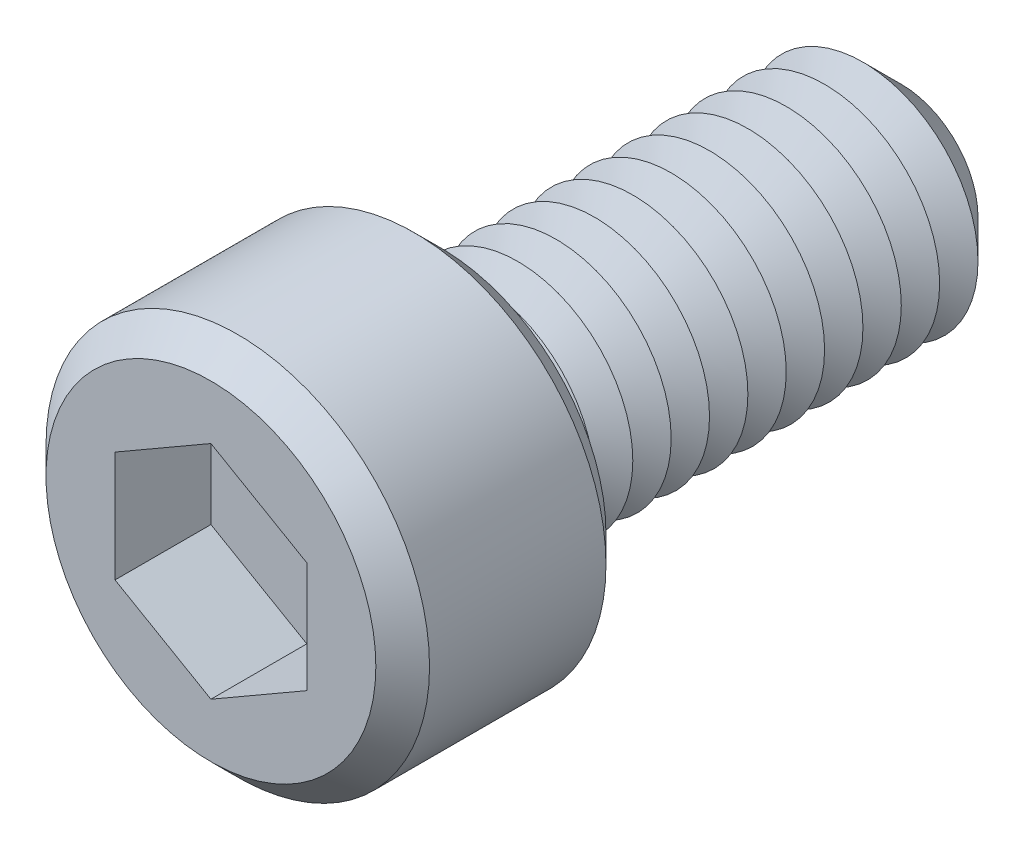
ISO-10303-21;
HEADER;
FILE_DESCRIPTION(('STEP AP214'),'2;1');
FILE_NAME('part.step','',(''),(''),'','','');
FILE_SCHEMA(('AUTOMOTIVE_DESIGN { 1 0 10303 214 1 1 1 1 }'));
ENDSEC;
DATA;
#1=APPLICATION_CONTEXT('core data for automotive mechanical design processes');
#2=APPLICATION_PROTOCOL_DEFINITION('international standard','automotive_design',2000,#1);
#3=PRODUCT_CONTEXT('',#1,'mechanical');
#4=PRODUCT('Part','Part','',(#3));
#5=PRODUCT_RELATED_PRODUCT_CATEGORY('part','',(#4));
#6=PRODUCT_DEFINITION_FORMATION('','',#4);
#7=PRODUCT_DEFINITION_CONTEXT('part definition',#1,'design');
#8=PRODUCT_DEFINITION('design','',#6,#7);
#9=PRODUCT_DEFINITION_SHAPE('','',#8);
#10=(LENGTH_UNIT() NAMED_UNIT(*) SI_UNIT(.MILLI.,.METRE.));
#11=(NAMED_UNIT(*) PLANE_ANGLE_UNIT() SI_UNIT($,.RADIAN.));
#12=(NAMED_UNIT(*) SI_UNIT($,.STERADIAN.) SOLID_ANGLE_UNIT());
#13=UNCERTAINTY_MEASURE_WITH_UNIT(LENGTH_MEASURE(1.E-05),#10,'distance_accuracy_value','');
#14=(GEOMETRIC_REPRESENTATION_CONTEXT(3) GLOBAL_UNCERTAINTY_ASSIGNED_CONTEXT((#13)) GLOBAL_UNIT_ASSIGNED_CONTEXT((#10,
#11,#12)) REPRESENTATION_CONTEXT('',''));
#15=CARTESIAN_POINT('',(0.,0.,0.));
#16=DIRECTION('',(0.,0.,1.));
#17=DIRECTION('',(1.,0.,0.));
#18=AXIS2_PLACEMENT_3D('',#15,#16,#17);
#19=CARTESIAN_POINT('',(0.,0.,6.));
#20=DIRECTION('',(0.,0.,-1.));
#21=DIRECTION('',(-1.,0.,0.));
#22=AXIS2_PLACEMENT_3D('',#19,#20,#21);
#23=CYLINDRICAL_SURFACE('',#22,5.);
#24=CARTESIAN_POINT('',(0.,0.,0.700000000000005));
#25=DIRECTION('',(0.,0.,1.));
#26=DIRECTION('',(1.,0.,0.));
#27=AXIS2_PLACEMENT_3D('',#24,#25,#26);
#28=CIRCLE('',#27,5.);
#29=CARTESIAN_POINT('',(5.,0.,0.700000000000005));
#30=VERTEX_POINT('',#29);
#31=EDGE_CURVE('E264',#30,#30,#28,.T.);
#32=ORIENTED_EDGE('',*,*,#31,.T.);
#33=EDGE_LOOP('',(#32));
#34=FACE_BOUND('',#33,.T.);
#35=CARTESIAN_POINT('',(0.,0.,5.3));
#36=DIRECTION('',(0.,0.,1.));
#37=DIRECTION('',(1.,0.,0.));
#38=AXIS2_PLACEMENT_3D('',#35,#36,#37);
#39=CIRCLE('',#38,5.);
#40=CARTESIAN_POINT('',(5.,0.,5.3));
#41=VERTEX_POINT('',#40);
#42=EDGE_CURVE('E260',#41,#41,#39,.F.);
#43=ORIENTED_EDGE('',*,*,#42,.T.);
#44=EDGE_LOOP('',(#43));
#45=FACE_BOUND('',#44,.T.);
#46=ADVANCED_FACE('F39',(#34,#45),#23,.T.);
#47=CARTESIAN_POINT('',(0.,0.,6.));
#48=DIRECTION('',(0.,0.,1.));
#49=DIRECTION('',(1.,0.,0.));
#50=AXIS2_PLACEMENT_3D('',#47,#48,#49);
#51=PLANE('',#50);
#52=CARTESIAN_POINT('',(0.,0.,6.));
#53=DIRECTION('',(0.,0.,1.));
#54=DIRECTION('',(1.,0.,0.));
#55=AXIS2_PLACEMENT_3D('',#52,#53,#54);
#56=CIRCLE('',#55,4.3);
#57=CARTESIAN_POINT('',(4.3,0.,6.));
#58=VERTEX_POINT('',#57);
#59=EDGE_CURVE('E11',#58,#58,#56,.T.);
#60=ORIENTED_EDGE('',*,*,#59,.T.);
#61=EDGE_LOOP('',(#60));
#62=FACE_BOUND('',#61,.T.);
#63=DIRECTION('',(-0.866025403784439,0.5,0.));
#64=VECTOR('',#63,1.);
#65=CARTESIAN_POINT('',(2.5,1.44337567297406,6.));
#66=LINE('',#65,#64);
#67=CARTESIAN_POINT('',(2.5,1.44337567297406,6.));
#68=VERTEX_POINT('',#67);
#69=CARTESIAN_POINT('',(0.,2.88675134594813,6.));
#70=VERTEX_POINT('',#69);
#71=EDGE_CURVE('E55',#68,#70,#66,.T.);
#72=ORIENTED_EDGE('',*,*,#71,.F.);
#73=DIRECTION('',(0.,1.,0.));
#74=VECTOR('',#73,1.);
#75=CARTESIAN_POINT('',(2.5,-1.44337567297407,6.));
#76=LINE('',#75,#74);
#77=CARTESIAN_POINT('',(2.5,-1.44337567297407,6.));
#78=VERTEX_POINT('',#77);
#79=EDGE_CURVE('E150',#78,#68,#76,.T.);
#80=ORIENTED_EDGE('',*,*,#79,.F.);
#81=DIRECTION('',(0.866025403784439,0.5,0.));
#82=VECTOR('',#81,1.);
#83=CARTESIAN_POINT('',(0.,-2.88675134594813,6.));
#84=LINE('',#83,#82);
#85=CARTESIAN_POINT('',(0.,-2.88675134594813,6.));
#86=VERTEX_POINT('',#85);
#87=EDGE_CURVE('E147',#86,#78,#84,.T.);
#88=ORIENTED_EDGE('',*,*,#87,.F.);
#89=DIRECTION('',(0.866025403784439,-0.5,0.));
#90=VECTOR('',#89,1.);
#91=CARTESIAN_POINT('',(-2.5,-1.44337567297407,6.));
#92=LINE('',#91,#90);
#93=CARTESIAN_POINT('',(-2.5,-1.44337567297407,6.));
#94=VERTEX_POINT('',#93);
#95=EDGE_CURVE('E103',#94,#86,#92,.T.);
#96=ORIENTED_EDGE('',*,*,#95,.F.);
#97=DIRECTION('',(0.,-1.,0.));
#98=VECTOR('',#97,1.);
#99=CARTESIAN_POINT('',(-2.5,1.44337567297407,6.));
#100=LINE('',#99,#98);
#101=CARTESIAN_POINT('',(-2.5,1.44337567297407,6.));
#102=VERTEX_POINT('',#101);
#103=EDGE_CURVE('E141',#102,#94,#100,.T.);
#104=ORIENTED_EDGE('',*,*,#103,.F.);
#105=DIRECTION('',(-0.866025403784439,-0.5,0.));
#106=VECTOR('',#105,1.);
#107=CARTESIAN_POINT('',(0.,2.88675134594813,6.));
#108=LINE('',#107,#106);
#109=EDGE_CURVE('E136',#70,#102,#108,.T.);
#110=ORIENTED_EDGE('',*,*,#109,.F.);
#111=EDGE_LOOP('',(#72,#80,#88,#96,#104,#110));
#112=FACE_BOUND('',#111,.T.);
#113=ADVANCED_FACE('F282',(#62,#112),#51,.T.);
#114=CARTESIAN_POINT('',(0.,0.,0.));
#115=DIRECTION('',(0.,0.,1.));
#116=DIRECTION('',(1.,0.,0.));
#117=AXIS2_PLACEMENT_3D('',#114,#115,#116);
#118=PLANE('',#117);
#119=CARTESIAN_POINT('',(0.,0.,0.));
#120=DIRECTION('',(0.,0.,1.));
#121=DIRECTION('',(1.,0.,0.));
#122=AXIS2_PLACEMENT_3D('',#119,#120,#121);
#123=CIRCLE('',#122,4.29999999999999);
#124=CARTESIAN_POINT('',(4.29999999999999,0.,0.));
#125=VERTEX_POINT('',#124);
#126=EDGE_CURVE('E48',#125,#125,#123,.F.);
#127=ORIENTED_EDGE('',*,*,#126,.T.);
#128=EDGE_LOOP('',(#127));
#129=FACE_BOUND('',#128,.T.);
#130=CARTESIAN_POINT('',(0.,0.,0.));
#131=DIRECTION('',(0.,0.,1.));
#132=DIRECTION('',(1.,0.,0.));
#133=AXIS2_PLACEMENT_3D('',#130,#131,#132);
#134=CIRCLE('',#133,3.);
#135=CARTESIAN_POINT('',(3.,0.,0.));
#136=VERTEX_POINT('',#135);
#137=EDGE_CURVE('E252',#136,#136,#134,.T.);
#138=ORIENTED_EDGE('',*,*,#137,.T.);
#139=EDGE_LOOP('',(#138));
#140=FACE_BOUND('',#139,.T.);
#141=ADVANCED_FACE('F271',(#129,#140),#118,.F.);
#142=CARTESIAN_POINT('',(0.,0.,0.));
#143=DIRECTION('',(0.,0.,1.));
#144=DIRECTION('',(1.,0.,0.));
#145=AXIS2_PLACEMENT_3D('',#142,#143,#144);
#146=CONICAL_SURFACE('',#145,3.,1.0471975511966);
#147=CARTESIAN_POINT('',(0.,0.,-0.500000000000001));
#148=DIRECTION('',(0.,0.,1.));
#149=DIRECTION('',(1.,0.,0.));
#150=AXIS2_PLACEMENT_3D('',#147,#148,#149);
#151=CIRCLE('',#150,2.13397459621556);
#152=CARTESIAN_POINT('',(2.13397459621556,0.,-0.500000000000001));
#153=VERTEX_POINT('',#152);
#154=EDGE_CURVE('E248',#153,#153,#151,.T.);
#155=ORIENTED_EDGE('',*,*,#154,.T.);
#156=EDGE_LOOP('',(#155));
#157=FACE_BOUND('',#156,.T.);
#158=ORIENTED_EDGE('',*,*,#137,.F.);
#159=EDGE_LOOP('',(#158));
#160=FACE_BOUND('',#159,.T.);
#161=ADVANCED_FACE('F420',(#157,#160),#146,.T.);
#162=CARTESIAN_POINT('',(0.,0.,-0.500000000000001));
#163=DIRECTION('',(0.,0.,-1.));
#164=DIRECTION('',(-1.,0.,0.));
#165=AXIS2_PLACEMENT_3D('',#162,#163,#164);
#166=CONICAL_SURFACE('',#165,2.13397459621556,1.0471975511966);
#167=CARTESIAN_POINT('',(0.,0.,-1.));
#168=DIRECTION('',(0.,0.,1.));
#169=DIRECTION('',(1.,0.,0.));
#170=AXIS2_PLACEMENT_3D('',#167,#168,#169);
#171=CIRCLE('',#170,3.);
#172=CARTESIAN_POINT('',(3.,0.,-1.));
#173=VERTEX_POINT('',#172);
#174=EDGE_CURVE('E244',#173,#173,#171,.T.);
#175=ORIENTED_EDGE('',*,*,#174,.T.);
#176=EDGE_LOOP('',(#175));
#177=FACE_BOUND('',#176,.T.);
#178=ORIENTED_EDGE('',*,*,#154,.F.);
#179=EDGE_LOOP('',(#178));
#180=FACE_BOUND('',#179,.T.);
#181=ADVANCED_FACE('F416',(#177,#180),#166,.T.);
#182=CARTESIAN_POINT('',(0.,0.,-1.));
#183=DIRECTION('',(0.,0.,1.));
#184=DIRECTION('',(1.,0.,0.));
#185=AXIS2_PLACEMENT_3D('',#182,#183,#184);
#186=CONICAL_SURFACE('',#185,3.,1.0471975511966);
#187=CARTESIAN_POINT('',(0.,0.,-1.5));
#188=DIRECTION('',(0.,0.,1.));
#189=DIRECTION('',(1.,0.,0.));
#190=AXIS2_PLACEMENT_3D('',#187,#188,#189);
#191=CIRCLE('',#190,2.13397459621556);
#192=CARTESIAN_POINT('',(2.13397459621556,0.,-1.5));
#193=VERTEX_POINT('',#192);
#194=EDGE_CURVE('E240',#193,#193,#191,.T.);
#195=ORIENTED_EDGE('',*,*,#194,.T.);
#196=EDGE_LOOP('',(#195));
#197=FACE_BOUND('',#196,.T.);
#198=ORIENTED_EDGE('',*,*,#174,.F.);
#199=EDGE_LOOP('',(#198));
#200=FACE_BOUND('',#199,.T.);
#201=ADVANCED_FACE('F412',(#197,#200),#186,.T.);
#202=CARTESIAN_POINT('',(0.,0.,-1.5));
#203=DIRECTION('',(0.,0.,-1.));
#204=DIRECTION('',(-1.,0.,0.));
#205=AXIS2_PLACEMENT_3D('',#202,#203,#204);
#206=CONICAL_SURFACE('',#205,2.13397459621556,1.0471975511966);
#207=CARTESIAN_POINT('',(0.,0.,-2.));
#208=DIRECTION('',(0.,0.,1.));
#209=DIRECTION('',(1.,0.,0.));
#210=AXIS2_PLACEMENT_3D('',#207,#208,#209);
#211=CIRCLE('',#210,3.);
#212=CARTESIAN_POINT('',(3.,0.,-2.));
#213=VERTEX_POINT('',#212);
#214=EDGE_CURVE('E236',#213,#213,#211,.T.);
#215=ORIENTED_EDGE('',*,*,#214,.T.);
#216=EDGE_LOOP('',(#215));
#217=FACE_BOUND('',#216,.T.);
#218=ORIENTED_EDGE('',*,*,#194,.F.);
#219=EDGE_LOOP('',(#218));
#220=FACE_BOUND('',#219,.T.);
#221=ADVANCED_FACE('F408',(#217,#220),#206,.T.);
#222=CARTESIAN_POINT('',(0.,0.,-2.));
#223=DIRECTION('',(0.,0.,1.));
#224=DIRECTION('',(1.,0.,0.));
#225=AXIS2_PLACEMENT_3D('',#222,#223,#224);
#226=CONICAL_SURFACE('',#225,3.,1.0471975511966);
#227=CARTESIAN_POINT('',(0.,0.,-2.5));
#228=DIRECTION('',(0.,0.,1.));
#229=DIRECTION('',(1.,0.,0.));
#230=AXIS2_PLACEMENT_3D('',#227,#228,#229);
#231=CIRCLE('',#230,2.13397459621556);
#232=CARTESIAN_POINT('',(2.13397459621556,0.,-2.5));
#233=VERTEX_POINT('',#232);
#234=EDGE_CURVE('E232',#233,#233,#231,.T.);
#235=ORIENTED_EDGE('',*,*,#234,.T.);
#236=EDGE_LOOP('',(#235));
#237=FACE_BOUND('',#236,.T.);
#238=ORIENTED_EDGE('',*,*,#214,.F.);
#239=EDGE_LOOP('',(#238));
#240=FACE_BOUND('',#239,.T.);
#241=ADVANCED_FACE('F404',(#237,#240),#226,.T.);
#242=CARTESIAN_POINT('',(0.,0.,-2.5));
#243=DIRECTION('',(0.,0.,-1.));
#244=DIRECTION('',(-1.,0.,0.));
#245=AXIS2_PLACEMENT_3D('',#242,#243,#244);
#246=CONICAL_SURFACE('',#245,2.13397459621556,1.0471975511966);
#247=CARTESIAN_POINT('',(0.,0.,-3.));
#248=DIRECTION('',(0.,0.,1.));
#249=DIRECTION('',(1.,0.,0.));
#250=AXIS2_PLACEMENT_3D('',#247,#248,#249);
#251=CIRCLE('',#250,3.);
#252=CARTESIAN_POINT('',(3.,0.,-3.));
#253=VERTEX_POINT('',#252);
#254=EDGE_CURVE('E228',#253,#253,#251,.T.);
#255=ORIENTED_EDGE('',*,*,#254,.T.);
#256=EDGE_LOOP('',(#255));
#257=FACE_BOUND('',#256,.T.);
#258=ORIENTED_EDGE('',*,*,#234,.F.);
#259=EDGE_LOOP('',(#258));
#260=FACE_BOUND('',#259,.T.);
#261=ADVANCED_FACE('F400',(#257,#260),#246,.T.);
#262=CARTESIAN_POINT('',(0.,0.,-3.));
#263=DIRECTION('',(0.,0.,1.));
#264=DIRECTION('',(1.,0.,0.));
#265=AXIS2_PLACEMENT_3D('',#262,#263,#264);
#266=CONICAL_SURFACE('',#265,3.,1.0471975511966);
#267=CARTESIAN_POINT('',(0.,0.,-3.5));
#268=DIRECTION('',(0.,0.,1.));
#269=DIRECTION('',(1.,0.,0.));
#270=AXIS2_PLACEMENT_3D('',#267,#268,#269);
#271=CIRCLE('',#270,2.13397459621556);
#272=CARTESIAN_POINT('',(2.13397459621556,0.,-3.5));
#273=VERTEX_POINT('',#272);
#274=EDGE_CURVE('E224',#273,#273,#271,.T.);
#275=ORIENTED_EDGE('',*,*,#274,.T.);
#276=EDGE_LOOP('',(#275));
#277=FACE_BOUND('',#276,.T.);
#278=ORIENTED_EDGE('',*,*,#254,.F.);
#279=EDGE_LOOP('',(#278));
#280=FACE_BOUND('',#279,.T.);
#281=ADVANCED_FACE('F396',(#277,#280),#266,.T.);
#282=CARTESIAN_POINT('',(0.,0.,-3.5));
#283=DIRECTION('',(0.,0.,-1.));
#284=DIRECTION('',(-1.,0.,0.));
#285=AXIS2_PLACEMENT_3D('',#282,#283,#284);
#286=CONICAL_SURFACE('',#285,2.13397459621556,1.0471975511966);
#287=CARTESIAN_POINT('',(0.,0.,-4.));
#288=DIRECTION('',(0.,0.,1.));
#289=DIRECTION('',(1.,0.,0.));
#290=AXIS2_PLACEMENT_3D('',#287,#288,#289);
#291=CIRCLE('',#290,3.);
#292=CARTESIAN_POINT('',(3.,0.,-4.));
#293=VERTEX_POINT('',#292);
#294=EDGE_CURVE('E220',#293,#293,#291,.T.);
#295=ORIENTED_EDGE('',*,*,#294,.T.);
#296=EDGE_LOOP('',(#295));
#297=FACE_BOUND('',#296,.T.);
#298=ORIENTED_EDGE('',*,*,#274,.F.);
#299=EDGE_LOOP('',(#298));
#300=FACE_BOUND('',#299,.T.);
#301=ADVANCED_FACE('F392',(#297,#300),#286,.T.);
#302=CARTESIAN_POINT('',(0.,0.,-4.));
#303=DIRECTION('',(0.,0.,1.));
#304=DIRECTION('',(1.,0.,0.));
#305=AXIS2_PLACEMENT_3D('',#302,#303,#304);
#306=CONICAL_SURFACE('',#305,3.,1.0471975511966);
#307=CARTESIAN_POINT('',(0.,0.,-4.5));
#308=DIRECTION('',(0.,0.,1.));
#309=DIRECTION('',(1.,0.,0.));
#310=AXIS2_PLACEMENT_3D('',#307,#308,#309);
#311=CIRCLE('',#310,2.13397459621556);
#312=CARTESIAN_POINT('',(2.13397459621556,0.,-4.5));
#313=VERTEX_POINT('',#312);
#314=EDGE_CURVE('E216',#313,#313,#311,.T.);
#315=ORIENTED_EDGE('',*,*,#314,.T.);
#316=EDGE_LOOP('',(#315));
#317=FACE_BOUND('',#316,.T.);
#318=ORIENTED_EDGE('',*,*,#294,.F.);
#319=EDGE_LOOP('',(#318));
#320=FACE_BOUND('',#319,.T.);
#321=ADVANCED_FACE('F388',(#317,#320),#306,.T.);
#322=CARTESIAN_POINT('',(0.,0.,-4.5));
#323=DIRECTION('',(0.,0.,-1.));
#324=DIRECTION('',(-1.,0.,0.));
#325=AXIS2_PLACEMENT_3D('',#322,#323,#324);
#326=CONICAL_SURFACE('',#325,2.13397459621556,1.0471975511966);
#327=CARTESIAN_POINT('',(0.,0.,-5.));
#328=DIRECTION('',(0.,0.,1.));
#329=DIRECTION('',(1.,0.,0.));
#330=AXIS2_PLACEMENT_3D('',#327,#328,#329);
#331=CIRCLE('',#330,3.);
#332=CARTESIAN_POINT('',(3.,0.,-5.));
#333=VERTEX_POINT('',#332);
#334=EDGE_CURVE('E212',#333,#333,#331,.T.);
#335=ORIENTED_EDGE('',*,*,#334,.T.);
#336=EDGE_LOOP('',(#335));
#337=FACE_BOUND('',#336,.T.);
#338=ORIENTED_EDGE('',*,*,#314,.F.);
#339=EDGE_LOOP('',(#338));
#340=FACE_BOUND('',#339,.T.);
#341=ADVANCED_FACE('F384',(#337,#340),#326,.T.);
#342=CARTESIAN_POINT('',(0.,0.,-5.));
#343=DIRECTION('',(0.,0.,1.));
#344=DIRECTION('',(1.,0.,0.));
#345=AXIS2_PLACEMENT_3D('',#342,#343,#344);
#346=CONICAL_SURFACE('',#345,3.,1.0471975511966);
#347=CARTESIAN_POINT('',(0.,0.,-5.5));
#348=DIRECTION('',(0.,0.,1.));
#349=DIRECTION('',(1.,0.,0.));
#350=AXIS2_PLACEMENT_3D('',#347,#348,#349);
#351=CIRCLE('',#350,2.13397459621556);
#352=CARTESIAN_POINT('',(2.13397459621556,0.,-5.5));
#353=VERTEX_POINT('',#352);
#354=EDGE_CURVE('E208',#353,#353,#351,.T.);
#355=ORIENTED_EDGE('',*,*,#354,.T.);
#356=EDGE_LOOP('',(#355));
#357=FACE_BOUND('',#356,.T.);
#358=ORIENTED_EDGE('',*,*,#334,.F.);
#359=EDGE_LOOP('',(#358));
#360=FACE_BOUND('',#359,.T.);
#361=ADVANCED_FACE('F380',(#357,#360),#346,.T.);
#362=CARTESIAN_POINT('',(0.,0.,-5.5));
#363=DIRECTION('',(0.,0.,-1.));
#364=DIRECTION('',(-1.,0.,0.));
#365=AXIS2_PLACEMENT_3D('',#362,#363,#364);
#366=CONICAL_SURFACE('',#365,2.13397459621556,1.0471975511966);
#367=CARTESIAN_POINT('',(0.,0.,-6.));
#368=DIRECTION('',(0.,0.,1.));
#369=DIRECTION('',(1.,0.,0.));
#370=AXIS2_PLACEMENT_3D('',#367,#368,#369);
#371=CIRCLE('',#370,3.);
#372=CARTESIAN_POINT('',(3.,0.,-6.));
#373=VERTEX_POINT('',#372);
#374=EDGE_CURVE('E204',#373,#373,#371,.T.);
#375=ORIENTED_EDGE('',*,*,#374,.T.);
#376=EDGE_LOOP('',(#375));
#377=FACE_BOUND('',#376,.T.);
#378=ORIENTED_EDGE('',*,*,#354,.F.);
#379=EDGE_LOOP('',(#378));
#380=FACE_BOUND('',#379,.T.);
#381=ADVANCED_FACE('F376',(#377,#380),#366,.T.);
#382=CARTESIAN_POINT('',(0.,0.,-6.));
#383=DIRECTION('',(0.,0.,1.));
#384=DIRECTION('',(1.,0.,0.));
#385=AXIS2_PLACEMENT_3D('',#382,#383,#384);
#386=CONICAL_SURFACE('',#385,3.,1.0471975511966);
#387=CARTESIAN_POINT('',(0.,0.,-6.5));
#388=DIRECTION('',(0.,0.,1.));
#389=DIRECTION('',(1.,0.,0.));
#390=AXIS2_PLACEMENT_3D('',#387,#388,#389);
#391=CIRCLE('',#390,2.13397459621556);
#392=CARTESIAN_POINT('',(2.13397459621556,0.,-6.5));
#393=VERTEX_POINT('',#392);
#394=EDGE_CURVE('E200',#393,#393,#391,.T.);
#395=ORIENTED_EDGE('',*,*,#394,.T.);
#396=EDGE_LOOP('',(#395));
#397=FACE_BOUND('',#396,.T.);
#398=ORIENTED_EDGE('',*,*,#374,.F.);
#399=EDGE_LOOP('',(#398));
#400=FACE_BOUND('',#399,.T.);
#401=ADVANCED_FACE('F372',(#397,#400),#386,.T.);
#402=CARTESIAN_POINT('',(0.,0.,-6.5));
#403=DIRECTION('',(0.,0.,-1.));
#404=DIRECTION('',(-1.,0.,0.));
#405=AXIS2_PLACEMENT_3D('',#402,#403,#404);
#406=CONICAL_SURFACE('',#405,2.13397459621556,1.0471975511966);
#407=CARTESIAN_POINT('',(0.,0.,-7.));
#408=DIRECTION('',(0.,0.,1.));
#409=DIRECTION('',(1.,0.,0.));
#410=AXIS2_PLACEMENT_3D('',#407,#408,#409);
#411=CIRCLE('',#410,3.);
#412=CARTESIAN_POINT('',(3.,0.,-7.));
#413=VERTEX_POINT('',#412);
#414=EDGE_CURVE('E196',#413,#413,#411,.T.);
#415=ORIENTED_EDGE('',*,*,#414,.T.);
#416=EDGE_LOOP('',(#415));
#417=FACE_BOUND('',#416,.T.);
#418=ORIENTED_EDGE('',*,*,#394,.F.);
#419=EDGE_LOOP('',(#418));
#420=FACE_BOUND('',#419,.T.);
#421=ADVANCED_FACE('F368',(#417,#420),#406,.T.);
#422=CARTESIAN_POINT('',(0.,0.,-7.));
#423=DIRECTION('',(0.,0.,1.));
#424=DIRECTION('',(1.,0.,0.));
#425=AXIS2_PLACEMENT_3D('',#422,#423,#424);
#426=CONICAL_SURFACE('',#425,3.,1.0471975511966);
#427=CARTESIAN_POINT('',(0.,0.,-7.5));
#428=DIRECTION('',(0.,0.,1.));
#429=DIRECTION('',(1.,0.,0.));
#430=AXIS2_PLACEMENT_3D('',#427,#428,#429);
#431=CIRCLE('',#430,2.13397459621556);
#432=CARTESIAN_POINT('',(2.13397459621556,0.,-7.5));
#433=VERTEX_POINT('',#432);
#434=EDGE_CURVE('E192',#433,#433,#431,.T.);
#435=ORIENTED_EDGE('',*,*,#434,.T.);
#436=EDGE_LOOP('',(#435));
#437=FACE_BOUND('',#436,.T.);
#438=ORIENTED_EDGE('',*,*,#414,.F.);
#439=EDGE_LOOP('',(#438));
#440=FACE_BOUND('',#439,.T.);
#441=ADVANCED_FACE('F364',(#437,#440),#426,.T.);
#442=CARTESIAN_POINT('',(0.,0.,-7.5));
#443=DIRECTION('',(0.,0.,-1.));
#444=DIRECTION('',(-1.,0.,0.));
#445=AXIS2_PLACEMENT_3D('',#442,#443,#444);
#446=CONICAL_SURFACE('',#445,2.13397459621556,1.0471975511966);
#447=CARTESIAN_POINT('',(0.,0.,-8.));
#448=DIRECTION('',(0.,0.,1.));
#449=DIRECTION('',(1.,0.,0.));
#450=AXIS2_PLACEMENT_3D('',#447,#448,#449);
#451=CIRCLE('',#450,3.);
#452=CARTESIAN_POINT('',(3.,0.,-8.));
#453=VERTEX_POINT('',#452);
#454=EDGE_CURVE('E188',#453,#453,#451,.T.);
#455=ORIENTED_EDGE('',*,*,#454,.T.);
#456=EDGE_LOOP('',(#455));
#457=FACE_BOUND('',#456,.T.);
#458=ORIENTED_EDGE('',*,*,#434,.F.);
#459=EDGE_LOOP('',(#458));
#460=FACE_BOUND('',#459,.T.);
#461=ADVANCED_FACE('F360',(#457,#460),#446,.T.);
#462=CARTESIAN_POINT('',(0.,0.,-8.));
#463=DIRECTION('',(0.,0.,1.));
#464=DIRECTION('',(1.,0.,0.));
#465=AXIS2_PLACEMENT_3D('',#462,#463,#464);
#466=CONICAL_SURFACE('',#465,3.,1.0471975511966);
#467=CARTESIAN_POINT('',(0.,0.,-8.5));
#468=DIRECTION('',(0.,0.,1.));
#469=DIRECTION('',(1.,0.,0.));
#470=AXIS2_PLACEMENT_3D('',#467,#468,#469);
#471=CIRCLE('',#470,2.13397459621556);
#472=CARTESIAN_POINT('',(2.13397459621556,0.,-8.5));
#473=VERTEX_POINT('',#472);
#474=EDGE_CURVE('E185',#473,#473,#471,.T.);
#475=ORIENTED_EDGE('',*,*,#474,.T.);
#476=EDGE_LOOP('',(#475));
#477=FACE_BOUND('',#476,.T.);
#478=ORIENTED_EDGE('',*,*,#454,.F.);
#479=EDGE_LOOP('',(#478));
#480=FACE_BOUND('',#479,.T.);
#481=ADVANCED_FACE('F356',(#477,#480),#466,.T.);
#482=CARTESIAN_POINT('',(0.,0.,-8.5));
#483=DIRECTION('',(0.,0.,-1.));
#484=DIRECTION('',(-1.,0.,0.));
#485=AXIS2_PLACEMENT_3D('',#482,#483,#484);
#486=CONICAL_SURFACE('',#485,2.13397459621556,1.0471975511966);
#487=CARTESIAN_POINT('',(0.,0.,-9.));
#488=DIRECTION('',(0.,0.,1.));
#489=DIRECTION('',(1.,0.,0.));
#490=AXIS2_PLACEMENT_3D('',#487,#488,#489);
#491=CIRCLE('',#490,3.);
#492=CARTESIAN_POINT('',(3.,0.,-9.));
#493=VERTEX_POINT('',#492);
#494=EDGE_CURVE('E181',#493,#493,#491,.T.);
#495=ORIENTED_EDGE('',*,*,#494,.T.);
#496=EDGE_LOOP('',(#495));
#497=FACE_BOUND('',#496,.T.);
#498=ORIENTED_EDGE('',*,*,#474,.F.);
#499=EDGE_LOOP('',(#498));
#500=FACE_BOUND('',#499,.T.);
#501=ADVANCED_FACE('F352',(#497,#500),#486,.T.);
#502=CARTESIAN_POINT('',(0.,0.,-9.));
#503=DIRECTION('',(0.,0.,1.));
#504=DIRECTION('',(1.,0.,0.));
#505=AXIS2_PLACEMENT_3D('',#502,#503,#504);
#506=CONICAL_SURFACE('',#505,3.,1.0471975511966);
#507=CARTESIAN_POINT('',(0.,0.,-9.5));
#508=DIRECTION('',(0.,0.,1.));
#509=DIRECTION('',(1.,0.,0.));
#510=AXIS2_PLACEMENT_3D('',#507,#508,#509);
#511=CIRCLE('',#510,2.13397459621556);
#512=CARTESIAN_POINT('',(2.13397459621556,0.,-9.5));
#513=VERTEX_POINT('',#512);
#514=EDGE_CURVE('E177',#513,#513,#511,.T.);
#515=ORIENTED_EDGE('',*,*,#514,.T.);
#516=EDGE_LOOP('',(#515));
#517=FACE_BOUND('',#516,.T.);
#518=ORIENTED_EDGE('',*,*,#494,.F.);
#519=EDGE_LOOP('',(#518));
#520=FACE_BOUND('',#519,.T.);
#521=ADVANCED_FACE('F348',(#517,#520),#506,.T.);
#522=CARTESIAN_POINT('',(0.,0.,-9.5));
#523=DIRECTION('',(0.,0.,-1.));
#524=DIRECTION('',(-1.,0.,0.));
#525=AXIS2_PLACEMENT_3D('',#522,#523,#524);
#526=CONICAL_SURFACE('',#525,2.13397459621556,1.0471975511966);
#527=CARTESIAN_POINT('',(0.,0.,-10.));
#528=DIRECTION('',(0.,0.,1.));
#529=DIRECTION('',(1.,0.,0.));
#530=AXIS2_PLACEMENT_3D('',#527,#528,#529);
#531=CIRCLE('',#530,3.);
#532=CARTESIAN_POINT('',(3.,0.,-10.));
#533=VERTEX_POINT('',#532);
#534=EDGE_CURVE('E173',#533,#533,#531,.T.);
#535=ORIENTED_EDGE('',*,*,#534,.T.);
#536=EDGE_LOOP('',(#535));
#537=FACE_BOUND('',#536,.T.);
#538=ORIENTED_EDGE('',*,*,#514,.F.);
#539=EDGE_LOOP('',(#538));
#540=FACE_BOUND('',#539,.T.);
#541=ADVANCED_FACE('F344',(#537,#540),#526,.T.);
#542=CARTESIAN_POINT('',(0.,0.,-10.));
#543=DIRECTION('',(0.,0.,1.));
#544=DIRECTION('',(1.,0.,0.));
#545=AXIS2_PLACEMENT_3D('',#542,#543,#544);
#546=CONICAL_SURFACE('',#545,3.,1.0471975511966);
#547=CARTESIAN_POINT('',(0.,0.,-10.5));
#548=DIRECTION('',(0.,0.,1.));
#549=DIRECTION('',(1.,0.,0.));
#550=AXIS2_PLACEMENT_3D('',#547,#548,#549);
#551=CIRCLE('',#550,2.13397459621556);
#552=CARTESIAN_POINT('',(2.13397459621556,0.,-10.5));
#553=VERTEX_POINT('',#552);
#554=EDGE_CURVE('E169',#553,#553,#551,.T.);
#555=ORIENTED_EDGE('',*,*,#554,.T.);
#556=EDGE_LOOP('',(#555));
#557=FACE_BOUND('',#556,.T.);
#558=ORIENTED_EDGE('',*,*,#534,.F.);
#559=EDGE_LOOP('',(#558));
#560=FACE_BOUND('',#559,.T.);
#561=ADVANCED_FACE('F340',(#557,#560),#546,.T.);
#562=CARTESIAN_POINT('',(0.,0.,-10.5));
#563=DIRECTION('',(0.,0.,-1.));
#564=DIRECTION('',(-1.,0.,0.));
#565=AXIS2_PLACEMENT_3D('',#562,#563,#564);
#566=CONICAL_SURFACE('',#565,2.13397459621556,1.0471975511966);
#567=CARTESIAN_POINT('',(0.,0.,-11.));
#568=DIRECTION('',(0.,0.,1.));
#569=DIRECTION('',(1.,0.,0.));
#570=AXIS2_PLACEMENT_3D('',#567,#568,#569);
#571=CIRCLE('',#570,3.);
#572=CARTESIAN_POINT('',(3.,0.,-11.));
#573=VERTEX_POINT('',#572);
#574=EDGE_CURVE('E156',#573,#573,#571,.T.);
#575=ORIENTED_EDGE('',*,*,#574,.T.);
#576=EDGE_LOOP('',(#575));
#577=FACE_BOUND('',#576,.T.);
#578=ORIENTED_EDGE('',*,*,#554,.F.);
#579=EDGE_LOOP('',(#578));
#580=FACE_BOUND('',#579,.T.);
#581=ADVANCED_FACE('F336',(#577,#580),#566,.T.);
#582=CARTESIAN_POINT('',(0.,0.,-12.));
#583=DIRECTION('',(0.,0.,-1.));
#584=DIRECTION('',(-1.,0.,0.));
#585=AXIS2_PLACEMENT_3D('',#582,#583,#584);
#586=PLANE('',#585);
#587=CARTESIAN_POINT('',(0.,0.,-12.));
#588=DIRECTION('',(0.,0.,-1.));
#589=DIRECTION('',(-1.,0.,0.));
#590=AXIS2_PLACEMENT_3D('',#587,#588,#589);
#591=CIRCLE('',#590,0.8);
#592=CARTESIAN_POINT('',(-0.8,0.,-12.));
#593=VERTEX_POINT('',#592);
#594=EDGE_CURVE('E137',#593,#593,#591,.F.);
#595=ORIENTED_EDGE('',*,*,#594,.T.);
#596=EDGE_LOOP('',(#595));
#597=FACE_BOUND('',#596,.T.);
#598=CARTESIAN_POINT('',(0.,0.,-12.));
#599=DIRECTION('',(0.,0.,-1.));
#600=DIRECTION('',(-1.,0.,0.));
#601=AXIS2_PLACEMENT_3D('',#598,#599,#600);
#602=CIRCLE('',#601,2.);
#603=CARTESIAN_POINT('',(-2.,0.,-12.));
#604=VERTEX_POINT('',#603);
#605=EDGE_CURVE('E256',#604,#604,#602,.T.);
#606=ORIENTED_EDGE('',*,*,#605,.T.);
#607=EDGE_LOOP('',(#606));
#608=FACE_BOUND('',#607,.T.);
#609=ADVANCED_FACE('F339',(#597,#608),#586,.T.);
#610=CARTESIAN_POINT('',(0.,0.,-12.));
#611=DIRECTION('',(0.,0.,1.));
#612=DIRECTION('',(1.,0.,0.));
#613=AXIS2_PLACEMENT_3D('',#610,#611,#612);
#614=CONICAL_SURFACE('',#613,2.,0.785398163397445);
#615=ORIENTED_EDGE('',*,*,#574,.F.);
#616=EDGE_LOOP('',(#615));
#617=FACE_BOUND('',#616,.T.);
#618=ORIENTED_EDGE('',*,*,#605,.F.);
#619=EDGE_LOOP('',(#618));
#620=FACE_BOUND('',#619,.T.);
#621=ADVANCED_FACE('F335',(#617,#620),#614,.T.);
#622=CARTESIAN_POINT('',(2.5,1.44337567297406,3.5));
#623=DIRECTION('',(0.5,0.866025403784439,0.));
#624=DIRECTION('',(-0.866025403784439,0.5,0.));
#625=AXIS2_PLACEMENT_3D('',#622,#623,#624);
#626=PLANE('',#625);
#627=ORIENTED_EDGE('',*,*,#71,.T.);
#628=DIRECTION('',(0.,0.,1.));
#629=VECTOR('',#628,1.);
#630=CARTESIAN_POINT('',(0.,2.88675134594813,3.5));
#631=LINE('',#630,#629);
#632=CARTESIAN_POINT('',(0.,2.88675134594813,3.5));
#633=VERTEX_POINT('',#632);
#634=EDGE_CURVE('E85',#633,#70,#631,.T.);
#635=ORIENTED_EDGE('',*,*,#634,.F.);
#636=DIRECTION('',(-0.866025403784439,0.5,0.));
#637=VECTOR('',#636,1.);
#638=CARTESIAN_POINT('',(2.5,1.44337567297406,3.5));
#639=LINE('',#638,#637);
#640=CARTESIAN_POINT('',(2.5,1.44337567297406,3.5));
#641=VERTEX_POINT('',#640);
#642=EDGE_CURVE('E153',#641,#633,#639,.T.);
#643=ORIENTED_EDGE('',*,*,#642,.F.);
#644=DIRECTION('',(0.,0.,1.));
#645=VECTOR('',#644,1.);
#646=CARTESIAN_POINT('',(2.5,1.44337567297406,3.5));
#647=LINE('',#646,#645);
#648=EDGE_CURVE('E63',#641,#68,#647,.T.);
#649=ORIENTED_EDGE('',*,*,#648,.T.);
#650=EDGE_LOOP('',(#627,#635,#643,#649));
#651=FACE_BOUND('',#650,.T.);
#652=ADVANCED_FACE('F325',(#651),#626,.F.);
#653=CARTESIAN_POINT('',(2.5,-1.44337567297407,3.5));
#654=DIRECTION('',(1.,0.,0.));
#655=DIRECTION('',(0.,1.,0.));
#656=AXIS2_PLACEMENT_3D('',#653,#654,#655);
#657=PLANE('',#656);
#658=ORIENTED_EDGE('',*,*,#79,.T.);
#659=ORIENTED_EDGE('',*,*,#648,.F.);
#660=DIRECTION('',(0.,1.,0.));
#661=VECTOR('',#660,1.);
#662=CARTESIAN_POINT('',(2.5,-1.44337567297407,3.5));
#663=LINE('',#662,#661);
#664=CARTESIAN_POINT('',(2.5,-1.44337567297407,3.5));
#665=VERTEX_POINT('',#664);
#666=EDGE_CURVE('E117',#665,#641,#663,.T.);
#667=ORIENTED_EDGE('',*,*,#666,.F.);
#668=DIRECTION('',(0.,0.,1.));
#669=VECTOR('',#668,1.);
#670=CARTESIAN_POINT('',(2.5,-1.44337567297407,3.5));
#671=LINE('',#670,#669);
#672=EDGE_CURVE('E108',#665,#78,#671,.T.);
#673=ORIENTED_EDGE('',*,*,#672,.T.);
#674=EDGE_LOOP('',(#658,#659,#667,#673));
#675=FACE_BOUND('',#674,.T.);
#676=ADVANCED_FACE('F322',(#675),#657,.F.);
#677=CARTESIAN_POINT('',(0.,-2.88675134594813,3.5));
#678=DIRECTION('',(0.5,-0.866025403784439,0.));
#679=DIRECTION('',(0.866025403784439,0.5,0.));
#680=AXIS2_PLACEMENT_3D('',#677,#678,#679);
#681=PLANE('',#680);
#682=ORIENTED_EDGE('',*,*,#87,.T.);
#683=ORIENTED_EDGE('',*,*,#672,.F.);
#684=DIRECTION('',(0.866025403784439,0.5,0.));
#685=VECTOR('',#684,1.);
#686=CARTESIAN_POINT('',(0.,-2.88675134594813,3.5));
#687=LINE('',#686,#685);
#688=CARTESIAN_POINT('',(0.,-2.88675134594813,3.5));
#689=VERTEX_POINT('',#688);
#690=EDGE_CURVE('E112',#689,#665,#687,.T.);
#691=ORIENTED_EDGE('',*,*,#690,.F.);
#692=DIRECTION('',(0.,0.,1.));
#693=VECTOR('',#692,1.);
#694=CARTESIAN_POINT('',(0.,-2.88675134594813,3.5));
#695=LINE('',#694,#693);
#696=EDGE_CURVE('E96',#689,#86,#695,.T.);
#697=ORIENTED_EDGE('',*,*,#696,.T.);
#698=EDGE_LOOP('',(#682,#683,#691,#697));
#699=FACE_BOUND('',#698,.T.);
#700=ADVANCED_FACE('F113',(#699),#681,.F.);
#701=CARTESIAN_POINT('',(-2.5,-1.44337567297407,3.5));
#702=DIRECTION('',(-0.5,-0.866025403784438,0.));
#703=DIRECTION('',(0.866025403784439,-0.5,0.));
#704=AXIS2_PLACEMENT_3D('',#701,#702,#703);
#705=PLANE('',#704);
#706=ORIENTED_EDGE('',*,*,#95,.T.);
#707=ORIENTED_EDGE('',*,*,#696,.F.);
#708=DIRECTION('',(0.866025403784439,-0.5,0.));
#709=VECTOR('',#708,1.);
#710=CARTESIAN_POINT('',(-2.5,-1.44337567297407,3.5));
#711=LINE('',#710,#709);
#712=CARTESIAN_POINT('',(-2.5,-1.44337567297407,3.5));
#713=VERTEX_POINT('',#712);
#714=EDGE_CURVE('E100',#713,#689,#711,.T.);
#715=ORIENTED_EDGE('',*,*,#714,.F.);
#716=DIRECTION('',(0.,0.,1.));
#717=VECTOR('',#716,1.);
#718=CARTESIAN_POINT('',(-2.5,-1.44337567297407,3.5));
#719=LINE('',#718,#717);
#720=EDGE_CURVE('E109',#713,#94,#719,.T.);
#721=ORIENTED_EDGE('',*,*,#720,.T.);
#722=EDGE_LOOP('',(#706,#707,#715,#721));
#723=FACE_BOUND('',#722,.T.);
#724=ADVANCED_FACE('F98',(#723),#705,.F.);
#725=CARTESIAN_POINT('',(-2.5,1.44337567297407,3.5));
#726=DIRECTION('',(-1.,0.,0.));
#727=DIRECTION('',(0.,-1.,0.));
#728=AXIS2_PLACEMENT_3D('',#725,#726,#727);
#729=PLANE('',#728);
#730=ORIENTED_EDGE('',*,*,#103,.T.);
#731=ORIENTED_EDGE('',*,*,#720,.F.);
#732=DIRECTION('',(0.,-1.,0.));
#733=VECTOR('',#732,1.);
#734=CARTESIAN_POINT('',(-2.5,1.44337567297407,3.5));
#735=LINE('',#734,#733);
#736=CARTESIAN_POINT('',(-2.5,1.44337567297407,3.5));
#737=VERTEX_POINT('',#736);
#738=EDGE_CURVE('E123',#737,#713,#735,.T.);
#739=ORIENTED_EDGE('',*,*,#738,.F.);
#740=DIRECTION('',(0.,0.,1.));
#741=VECTOR('',#740,1.);
#742=CARTESIAN_POINT('',(-2.5,1.44337567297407,3.5));
#743=LINE('',#742,#741);
#744=EDGE_CURVE('E161',#737,#102,#743,.T.);
#745=ORIENTED_EDGE('',*,*,#744,.T.);
#746=EDGE_LOOP('',(#730,#731,#739,#745));
#747=FACE_BOUND('',#746,.T.);
#748=ADVANCED_FACE('F319',(#747),#729,.F.);
#749=CARTESIAN_POINT('',(0.,2.88675134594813,3.5));
#750=DIRECTION('',(-0.5,0.866025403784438,0.));
#751=DIRECTION('',(-0.866025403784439,-0.5,0.));
#752=AXIS2_PLACEMENT_3D('',#749,#750,#751);
#753=PLANE('',#752);
#754=ORIENTED_EDGE('',*,*,#109,.T.);
#755=ORIENTED_EDGE('',*,*,#744,.F.);
#756=DIRECTION('',(-0.866025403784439,-0.5,0.));
#757=VECTOR('',#756,1.);
#758=CARTESIAN_POINT('',(0.,2.88675134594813,3.5));
#759=LINE('',#758,#757);
#760=EDGE_CURVE('E128',#633,#737,#759,.T.);
#761=ORIENTED_EDGE('',*,*,#760,.F.);
#762=ORIENTED_EDGE('',*,*,#634,.T.);
#763=EDGE_LOOP('',(#754,#755,#761,#762));
#764=FACE_BOUND('',#763,.T.);
#765=ADVANCED_FACE('F297',(#764),#753,.F.);
#766=CARTESIAN_POINT('',(0.,0.,3.5));
#767=DIRECTION('',(0.,0.,1.));
#768=DIRECTION('',(1.,0.,0.));
#769=AXIS2_PLACEMENT_3D('',#766,#767,#768);
#770=PLANE('',#769);
#771=CARTESIAN_POINT('',(0.,0.,3.5));
#772=DIRECTION('',(0.,0.,1.));
#773=DIRECTION('',(1.,0.,0.));
#774=AXIS2_PLACEMENT_3D('',#771,#772,#773);
#775=CIRCLE('',#774,0.8);
#776=CARTESIAN_POINT('',(0.8,0.,3.5));
#777=VERTEX_POINT('',#776);
#778=EDGE_CURVE('E305',#777,#777,#775,.T.);
#779=ORIENTED_EDGE('',*,*,#778,.F.);
#780=EDGE_LOOP('',(#779));
#781=FACE_BOUND('',#780,.T.);
#782=ORIENTED_EDGE('',*,*,#642,.T.);
#783=ORIENTED_EDGE('',*,*,#760,.T.);
#784=ORIENTED_EDGE('',*,*,#738,.T.);
#785=ORIENTED_EDGE('',*,*,#714,.T.);
#786=ORIENTED_EDGE('',*,*,#690,.T.);
#787=ORIENTED_EDGE('',*,*,#666,.T.);
#788=EDGE_LOOP('',(#782,#783,#784,#785,#786,#787));
#789=FACE_BOUND('',#788,.T.);
#790=ADVANCED_FACE('F120',(#781,#789),#770,.T.);
#791=CARTESIAN_POINT('',(0.,0.,-14.262741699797));
#792=DIRECTION('',(0.,0.,1.));
#793=DIRECTION('',(1.,0.,0.));
#794=AXIS2_PLACEMENT_3D('',#791,#792,#793);
#795=CYLINDRICAL_SURFACE('',#794,0.8);
#796=ORIENTED_EDGE('',*,*,#778,.T.);
#797=EDGE_LOOP('',(#796));
#798=FACE_BOUND('',#797,.T.);
#799=ORIENTED_EDGE('',*,*,#594,.F.);
#800=EDGE_LOOP('',(#799));
#801=FACE_BOUND('',#800,.T.);
#802=ADVANCED_FACE('F277',(#798,#801),#795,.F.);
#803=CARTESIAN_POINT('',(0.,0.,0.700000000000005));
#804=DIRECTION('',(0.,0.,1.));
#805=DIRECTION('',(1.,0.,0.));
#806=AXIS2_PLACEMENT_3D('',#803,#804,#805);
#807=CONICAL_SURFACE('',#806,5.,0.785398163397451);
#808=ORIENTED_EDGE('',*,*,#126,.F.);
#809=EDGE_LOOP('',(#808));
#810=FACE_BOUND('',#809,.T.);
#811=ORIENTED_EDGE('',*,*,#31,.F.);
#812=EDGE_LOOP('',(#811));
#813=FACE_BOUND('',#812,.T.);
#814=ADVANCED_FACE('F274',(#810,#813),#807,.T.);
#815=CARTESIAN_POINT('',(0.,0.,6.));
#816=DIRECTION('',(0.,0.,-1.));
#817=DIRECTION('',(-1.,0.,0.));
#818=AXIS2_PLACEMENT_3D('',#815,#816,#817);
#819=CONICAL_SURFACE('',#818,4.3,0.785398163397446);
#820=ORIENTED_EDGE('',*,*,#42,.F.);
#821=EDGE_LOOP('',(#820));
#822=FACE_BOUND('',#821,.T.);
#823=ORIENTED_EDGE('',*,*,#59,.F.);
#824=EDGE_LOOP('',(#823));
#825=FACE_BOUND('',#824,.T.);
#826=ADVANCED_FACE('F41',(#822,#825),#819,.T.);
#827=CLOSED_SHELL('',(#46,#113,#141,#161,#181,#201,#221,#241,#261,#281,#301,#321,#341,#361,#381,
#401,#421,#441,#461,#481,#501,#521,#541,#561,#581,#609,#621,#652,#676,#700,#724,#748,#765,#790,
#802,#814,#826));
#828=MANIFOLD_SOLID_BREP('B2',#827);
#829=ADVANCED_BREP_SHAPE_REPRESENTATION('',(#18,#828),#14);
#830=SHAPE_DEFINITION_REPRESENTATION(#9,#829);
ENDSEC;
END-ISO-10303-21;
